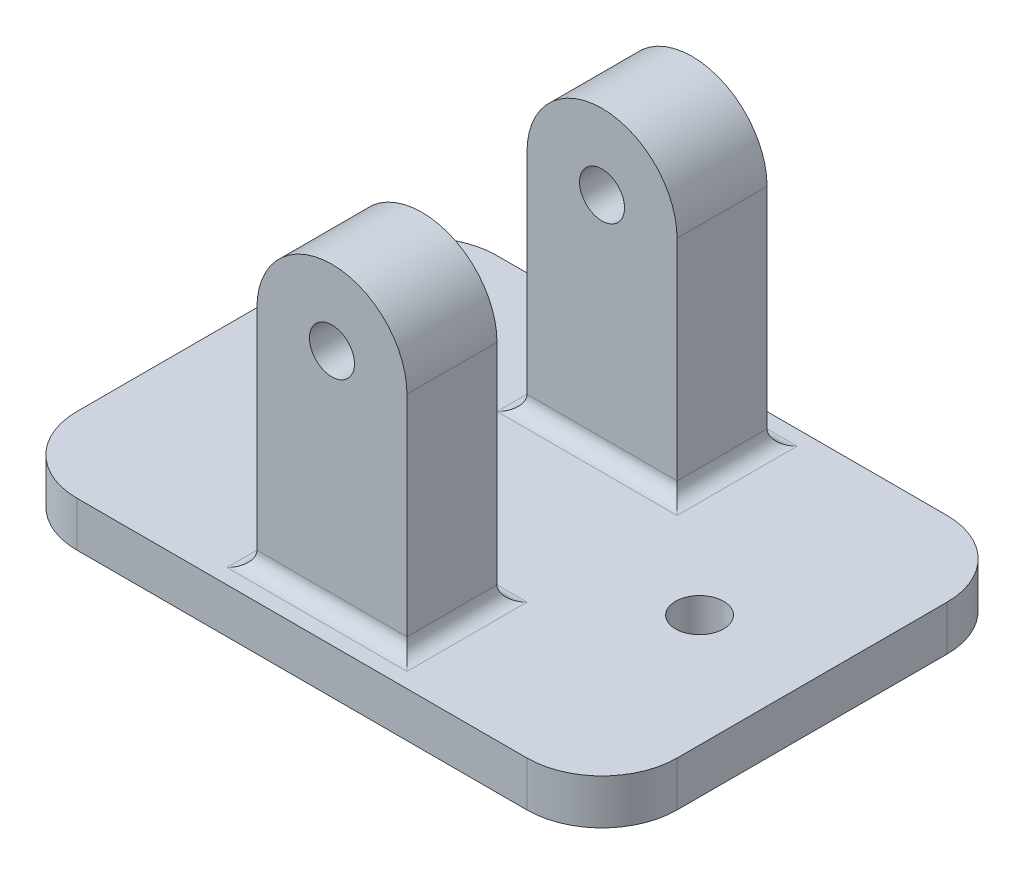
from build123d import *

# Parameters (mm, degrees)
BOSS_EXTRUDE1_DEPTH      = 12
BOSS_EXTRUDE1_DEPTH_BACK = 12
CUT_EXTRUDE1_DEPTH       = 20.849433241
CUT_EXTRUDE1_DEPTH_BACK  = 20.849433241
SKETCH1_4_R              = 1.5
SKETCH4_W                = 40
SKETCH4_H                = 28
SKETCH4_R                = 1.6
BOSS_EXTRUDE2_DEPTH      = 3
CUT_EXTRUDE2_DEPTH       = 6
CUT_EXTRUDE2_DEPTH_BACK  = 6
SKETCH1_5_R              = 1.5
FILLET1_R                = 5
FILLET2_R                = 1


with BuildPart() as part:
    # Sketch1 → Boss-Extrude1 (new, two sides: drawn at the far end of the back side and taken through both)
    with BuildSketch(Plane.XY.offset(-BOSS_EXTRUDE1_DEPTH_BACK)):
        with BuildLine():
            Line((-5, 0), (-5, -15))
            Line((-5, -15), (5, -15))
            Line((5, -15), (5, 0))
            ThreePointArc((5, 0), (0, 5), (-5, 0))
        make_face()
    extrude(amount=BOSS_EXTRUDE1_DEPTH + BOSS_EXTRUDE1_DEPTH_BACK)

    # Sketch1_4 → Cut-Extrude1 (cut, two sides: drawn at the far end of the back side and taken through both)
    with BuildSketch(Plane.XY.offset(-CUT_EXTRUDE1_DEPTH_BACK)):
        Circle(SKETCH1_4_R)
    extrude(amount=CUT_EXTRUDE1_DEPTH + CUT_EXTRUDE1_DEPTH_BACK, mode=Mode.SUBTRACT)

    # Sketch4 → Boss-Extrude2 (add)
    with BuildSketch(Plane.XZ.offset(15)):
        Rectangle(SKETCH4_W, SKETCH4_H)
        with Locations(Location((-12.5, 0, 0), (0, 0, 270))):
            Circle(SKETCH4_R, mode=Mode.SUBTRACT)
        with Locations(Location((12.5, 0, 0), (0, 0, 270))):
            Circle(SKETCH4_R, mode=Mode.SUBTRACT)
    extrude(amount=BOSS_EXTRUDE2_DEPTH)

    # Sketch1_5 → Cut-Extrude2 (cut, two sides: drawn at the far end of the back side and taken through both)
    with BuildSketch(Plane.XY.offset(-CUT_EXTRUDE2_DEPTH_BACK)):
        with BuildLine():
            Line((-5, 0), (-5, -15))
            Line((-5, -15), (5, -15))
            Line((5, -15), (5, 0))
            ThreePointArc((5, 0), (0, 5), (-5, 0))
        make_face()
        Circle(SKETCH1_5_R, mode=Mode.SUBTRACT)
    extrude(amount=CUT_EXTRUDE2_DEPTH + CUT_EXTRUDE2_DEPTH_BACK, mode=Mode.SUBTRACT)

    # Fillet1
    fillet1_edges = [part.edges().sort_by_distance(p)[0] for p in [
        (20, -16.5, -14),
        (20, -16.5, 14),
        (-20, -16.5, 14),
        (-20, -16.5, -14),
    ]]
    fillet(fillet1_edges, radius=FILLET1_R)

    # Fillet2
    fillet2_edges = [part.edges().sort_by_distance(p)[0] for p in [
        (0, -15, 12),
        (5, -15, 9),
        (-5, -15, 9),
        (0, -15, 6),
        (0, -15, -6),
        (0, -15, -12),
        (-5, -15, -9),
        (5, -15, -9),
    ]]
    fillet(fillet2_edges, radius=FILLET2_R)


solid = part.part
